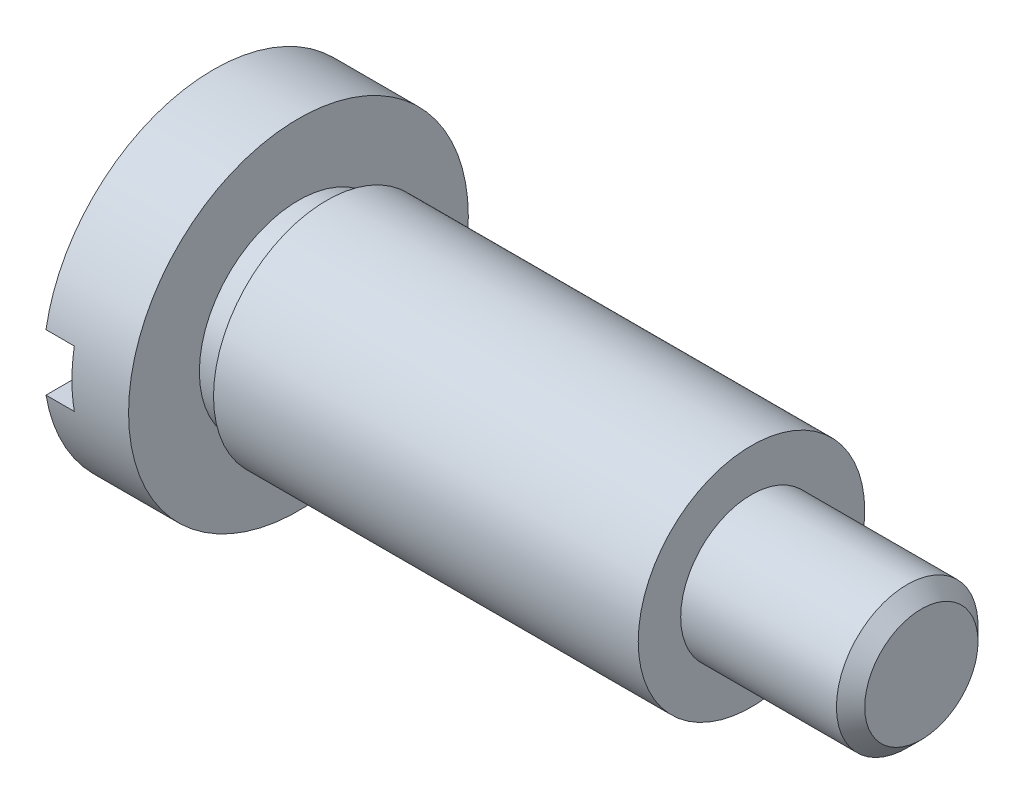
ISO-10303-21;
HEADER;
FILE_DESCRIPTION(('STEP AP214'),'2;1');
FILE_NAME('part.step','',(''),(''),'','','');
FILE_SCHEMA(('AUTOMOTIVE_DESIGN { 1 0 10303 214 1 1 1 1 }'));
ENDSEC;
DATA;
#1=APPLICATION_CONTEXT('core data for automotive mechanical design processes');
#2=APPLICATION_PROTOCOL_DEFINITION('international standard','automotive_design',2000,#1);
#3=PRODUCT_CONTEXT('',#1,'mechanical');
#4=PRODUCT('Part','Part','',(#3));
#5=PRODUCT_RELATED_PRODUCT_CATEGORY('part','',(#4));
#6=PRODUCT_DEFINITION_FORMATION('','',#4);
#7=PRODUCT_DEFINITION_CONTEXT('part definition',#1,'design');
#8=PRODUCT_DEFINITION('design','',#6,#7);
#9=PRODUCT_DEFINITION_SHAPE('','',#8);
#10=(LENGTH_UNIT() NAMED_UNIT(*) SI_UNIT(.MILLI.,.METRE.));
#11=(NAMED_UNIT(*) PLANE_ANGLE_UNIT() SI_UNIT($,.RADIAN.));
#12=(NAMED_UNIT(*) SI_UNIT($,.STERADIAN.) SOLID_ANGLE_UNIT());
#13=UNCERTAINTY_MEASURE_WITH_UNIT(LENGTH_MEASURE(1.E-05),#10,'distance_accuracy_value','');
#14=(GEOMETRIC_REPRESENTATION_CONTEXT(3) GLOBAL_UNCERTAINTY_ASSIGNED_CONTEXT((#13)) GLOBAL_UNIT_ASSIGNED_CONTEXT((#10,
#11,#12)) REPRESENTATION_CONTEXT('',''));
#15=CARTESIAN_POINT('',(0.,0.,0.));
#16=DIRECTION('',(0.,0.,1.));
#17=DIRECTION('',(1.,0.,0.));
#18=AXIS2_PLACEMENT_3D('',#15,#16,#17);
#19=CARTESIAN_POINT('',(0.,0.,0.));
#20=DIRECTION('',(1.,0.,0.));
#21=DIRECTION('',(0.,0.,-1.));
#22=AXIS2_PLACEMENT_3D('',#19,#20,#21);
#23=PLANE('',#22);
#24=CARTESIAN_POINT('',(0.,0.,0.));
#25=DIRECTION('',(-1.,0.,0.));
#26=DIRECTION('',(0.,0.,1.));
#27=AXIS2_PLACEMENT_3D('',#24,#25,#26);
#28=CIRCLE('',#27,3.);
#29=CARTESIAN_POINT('',(0.,0.5,2.95803989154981));
#30=VERTEX_POINT('',#29);
#31=CARTESIAN_POINT('',(0.,0.5,-2.95803989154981));
#32=VERTEX_POINT('',#31);
#33=EDGE_CURVE('E88',#30,#32,#28,.T.);
#34=ORIENTED_EDGE('',*,*,#33,.T.);
#35=DIRECTION('',(0.,0.,-1.));
#36=VECTOR('',#35,1.);
#37=CARTESIAN_POINT('',(0.,0.5,-3.35247769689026));
#38=LINE('',#37,#36);
#39=EDGE_CURVE('E82',#30,#32,#38,.T.);
#40=ORIENTED_EDGE('',*,*,#39,.F.);
#41=EDGE_LOOP('',(#34,#40));
#42=FACE_BOUND('',#41,.T.);
#43=ADVANCED_FACE('F33',(#42),#23,.F.);
#44=CARTESIAN_POINT('',(0.,-0.5,-2.95803989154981));
#45=VERTEX_POINT('',#44);
#46=CARTESIAN_POINT('',(0.,-0.5,2.95803989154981));
#47=VERTEX_POINT('',#46);
#48=EDGE_CURVE('E81',#45,#47,#28,.T.);
#49=ORIENTED_EDGE('',*,*,#48,.T.);
#50=DIRECTION('',(0.,0.,1.));
#51=VECTOR('',#50,1.);
#52=CARTESIAN_POINT('',(0.,-0.5,-3.35247769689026));
#53=LINE('',#52,#51);
#54=EDGE_CURVE('E74',#45,#47,#53,.T.);
#55=ORIENTED_EDGE('',*,*,#54,.F.);
#56=EDGE_LOOP('',(#49,#55));
#57=FACE_BOUND('',#56,.T.);
#58=ADVANCED_FACE('F80',(#57),#23,.F.);
#59=CARTESIAN_POINT('',(0.,0.,0.));
#60=DIRECTION('',(-1.,0.,0.));
#61=DIRECTION('',(0.,0.,1.));
#62=AXIS2_PLACEMENT_3D('',#59,#60,#61);
#63=CYLINDRICAL_SURFACE('',#62,3.);
#64=CARTESIAN_POINT('',(0.5,0.,0.));
#65=DIRECTION('',(-1.,0.,0.));
#66=DIRECTION('',(0.,0.,1.));
#67=AXIS2_PLACEMENT_3D('',#64,#65,#66);
#68=CIRCLE('',#67,3.);
#69=CARTESIAN_POINT('',(0.5,0.5,-2.95803989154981));
#70=VERTEX_POINT('',#69);
#71=CARTESIAN_POINT('',(0.5,-0.5,-2.95803989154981));
#72=VERTEX_POINT('',#71);
#73=EDGE_CURVE('E53',#70,#72,#68,.T.);
#74=ORIENTED_EDGE('',*,*,#73,.F.);
#75=DIRECTION('',(-1.,0.,0.));
#76=VECTOR('',#75,1.);
#77=CARTESIAN_POINT('',(0.,0.5,-2.95803989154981));
#78=LINE('',#77,#76);
#79=EDGE_CURVE('E11',#70,#32,#78,.T.);
#80=ORIENTED_EDGE('',*,*,#79,.T.);
#81=ORIENTED_EDGE('',*,*,#33,.F.);
#82=DIRECTION('',(-1.,0.,0.));
#83=VECTOR('',#82,1.);
#84=CARTESIAN_POINT('',(0.,0.5,2.95803989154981));
#85=LINE('',#84,#83);
#86=CARTESIAN_POINT('',(0.5,0.5,2.95803989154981));
#87=VERTEX_POINT('',#86);
#88=EDGE_CURVE('E106',#30,#87,#85,.F.);
#89=ORIENTED_EDGE('',*,*,#88,.T.);
#90=CARTESIAN_POINT('',(0.5,-0.5,2.95803989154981));
#91=VERTEX_POINT('',#90);
#92=EDGE_CURVE('E103',#91,#87,#68,.T.);
#93=ORIENTED_EDGE('',*,*,#92,.F.);
#94=DIRECTION('',(-1.,0.,0.));
#95=VECTOR('',#94,1.);
#96=CARTESIAN_POINT('',(0.,-0.5,2.95803989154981));
#97=LINE('',#96,#95);
#98=EDGE_CURVE('E87',#91,#47,#97,.T.);
#99=ORIENTED_EDGE('',*,*,#98,.T.);
#100=ORIENTED_EDGE('',*,*,#48,.F.);
#101=DIRECTION('',(-1.,0.,0.));
#102=VECTOR('',#101,1.);
#103=CARTESIAN_POINT('',(0.,-0.5,-2.95803989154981));
#104=LINE('',#103,#102);
#105=EDGE_CURVE('E41',#45,#72,#104,.F.);
#106=ORIENTED_EDGE('',*,*,#105,.T.);
#107=EDGE_LOOP('',(#74,#80,#81,#89,#93,#99,#100,#106));
#108=FACE_BOUND('',#107,.T.);
#109=CARTESIAN_POINT('',(1.5,0.,0.));
#110=DIRECTION('',(-1.,0.,0.));
#111=DIRECTION('',(0.,0.,1.));
#112=AXIS2_PLACEMENT_3D('',#109,#110,#111);
#113=CIRCLE('',#112,3.);
#114=CARTESIAN_POINT('',(1.5,0.,3.));
#115=VERTEX_POINT('',#114);
#116=EDGE_CURVE('E89',#115,#115,#113,.T.);
#117=ORIENTED_EDGE('',*,*,#116,.T.);
#118=EDGE_LOOP('',(#117));
#119=FACE_BOUND('',#118,.T.);
#120=ADVANCED_FACE('F84',(#108,#119),#63,.T.);
#121=CARTESIAN_POINT('',(1.5,2.23989718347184,0.));
#122=DIRECTION('',(-1.,0.,0.));
#123=DIRECTION('',(0.,0.,1.));
#124=AXIS2_PLACEMENT_3D('',#121,#122,#123);
#125=PLANE('',#124);
#126=ORIENTED_EDGE('',*,*,#116,.F.);
#127=EDGE_LOOP('',(#126));
#128=FACE_BOUND('',#127,.T.);
#129=CARTESIAN_POINT('',(1.5,0.,0.));
#130=DIRECTION('',(-1.,0.,0.));
#131=DIRECTION('',(0.,0.,1.));
#132=AXIS2_PLACEMENT_3D('',#129,#130,#131);
#133=CIRCLE('',#132,1.75);
#134=CARTESIAN_POINT('',(1.5,0.,1.75));
#135=VERTEX_POINT('',#134);
#136=EDGE_CURVE('E94',#135,#135,#133,.T.);
#137=ORIENTED_EDGE('',*,*,#136,.T.);
#138=EDGE_LOOP('',(#137));
#139=FACE_BOUND('',#138,.T.);
#140=ADVANCED_FACE('F133',(#128,#139),#125,.F.);
#141=CARTESIAN_POINT('',(0.,0.,0.));
#142=DIRECTION('',(-1.,0.,0.));
#143=DIRECTION('',(0.,0.,1.));
#144=AXIS2_PLACEMENT_3D('',#141,#142,#143);
#145=CYLINDRICAL_SURFACE('',#144,1.75);
#146=ORIENTED_EDGE('',*,*,#136,.F.);
#147=EDGE_LOOP('',(#146));
#148=FACE_BOUND('',#147,.T.);
#149=CARTESIAN_POINT('',(2.,0.,0.));
#150=DIRECTION('',(-1.,0.,0.));
#151=DIRECTION('',(0.,0.,1.));
#152=AXIS2_PLACEMENT_3D('',#149,#150,#151);
#153=CIRCLE('',#152,1.75);
#154=CARTESIAN_POINT('',(2.,0.,1.75));
#155=VERTEX_POINT('',#154);
#156=EDGE_CURVE('E128',#155,#155,#153,.T.);
#157=ORIENTED_EDGE('',*,*,#156,.T.);
#158=EDGE_LOOP('',(#157));
#159=FACE_BOUND('',#158,.T.);
#160=ADVANCED_FACE('F135',(#148,#159),#145,.T.);
#161=CARTESIAN_POINT('',(2.,2.,0.));
#162=DIRECTION('',(1.,0.,0.));
#163=DIRECTION('',(0.,0.,-1.));
#164=AXIS2_PLACEMENT_3D('',#161,#162,#163);
#165=PLANE('',#164);
#166=ORIENTED_EDGE('',*,*,#156,.F.);
#167=EDGE_LOOP('',(#166));
#168=FACE_BOUND('',#167,.T.);
#169=CARTESIAN_POINT('',(2.,0.,0.));
#170=DIRECTION('',(-1.,0.,0.));
#171=DIRECTION('',(0.,0.,1.));
#172=AXIS2_PLACEMENT_3D('',#169,#170,#171);
#173=CIRCLE('',#172,2.);
#174=CARTESIAN_POINT('',(2.,0.,2.));
#175=VERTEX_POINT('',#174);
#176=EDGE_CURVE('E125',#175,#175,#173,.T.);
#177=ORIENTED_EDGE('',*,*,#176,.T.);
#178=EDGE_LOOP('',(#177));
#179=FACE_BOUND('',#178,.T.);
#180=ADVANCED_FACE('F138',(#168,#179),#165,.F.);
#181=CARTESIAN_POINT('',(0.,0.,0.));
#182=DIRECTION('',(-1.,0.,0.));
#183=DIRECTION('',(0.,0.,1.));
#184=AXIS2_PLACEMENT_3D('',#181,#182,#183);
#185=CYLINDRICAL_SURFACE('',#184,2.);
#186=ORIENTED_EDGE('',*,*,#176,.F.);
#187=EDGE_LOOP('',(#186));
#188=FACE_BOUND('',#187,.T.);
#189=CARTESIAN_POINT('',(9.5,0.,0.));
#190=DIRECTION('',(-1.,0.,0.));
#191=DIRECTION('',(0.,0.,1.));
#192=AXIS2_PLACEMENT_3D('',#189,#190,#191);
#193=CIRCLE('',#192,2.);
#194=CARTESIAN_POINT('',(9.5,0.,2.));
#195=VERTEX_POINT('',#194);
#196=EDGE_CURVE('E122',#195,#195,#193,.T.);
#197=ORIENTED_EDGE('',*,*,#196,.T.);
#198=EDGE_LOOP('',(#197));
#199=FACE_BOUND('',#198,.T.);
#200=ADVANCED_FACE('F144',(#188,#199),#185,.T.);
#201=CARTESIAN_POINT('',(9.5,2.,0.));
#202=DIRECTION('',(-1.,0.,0.));
#203=DIRECTION('',(0.,0.,1.));
#204=AXIS2_PLACEMENT_3D('',#201,#202,#203);
#205=PLANE('',#204);
#206=ORIENTED_EDGE('',*,*,#196,.F.);
#207=EDGE_LOOP('',(#206));
#208=FACE_BOUND('',#207,.T.);
#209=CARTESIAN_POINT('',(9.5,0.,0.));
#210=DIRECTION('',(-1.,0.,0.));
#211=DIRECTION('',(0.,0.,1.));
#212=AXIS2_PLACEMENT_3D('',#209,#210,#211);
#213=CIRCLE('',#212,1.25);
#214=CARTESIAN_POINT('',(9.5,0.,1.25));
#215=VERTEX_POINT('',#214);
#216=EDGE_CURVE('E119',#215,#215,#213,.T.);
#217=ORIENTED_EDGE('',*,*,#216,.T.);
#218=EDGE_LOOP('',(#217));
#219=FACE_BOUND('',#218,.T.);
#220=ADVANCED_FACE('F150',(#208,#219),#205,.F.);
#221=CARTESIAN_POINT('',(0.,0.,0.));
#222=DIRECTION('',(-1.,0.,0.));
#223=DIRECTION('',(0.,0.,1.));
#224=AXIS2_PLACEMENT_3D('',#221,#222,#223);
#225=CYLINDRICAL_SURFACE('',#224,1.25);
#226=CARTESIAN_POINT('',(12.25,0.,0.));
#227=DIRECTION('',(-1.,0.,0.));
#228=DIRECTION('',(0.,0.,1.));
#229=AXIS2_PLACEMENT_3D('',#226,#227,#228);
#230=CIRCLE('',#229,1.25);
#231=CARTESIAN_POINT('',(12.25,0.,1.25));
#232=VERTEX_POINT('',#231);
#233=EDGE_CURVE('E92',#232,#232,#230,.T.);
#234=ORIENTED_EDGE('',*,*,#233,.T.);
#235=EDGE_LOOP('',(#234));
#236=FACE_BOUND('',#235,.T.);
#237=ORIENTED_EDGE('',*,*,#216,.F.);
#238=EDGE_LOOP('',(#237));
#239=FACE_BOUND('',#238,.T.);
#240=ADVANCED_FACE('F156',(#236,#239),#225,.T.);
#241=CARTESIAN_POINT('',(12.5,1.25,0.));
#242=DIRECTION('',(-1.,0.,0.));
#243=DIRECTION('',(0.,0.,1.));
#244=AXIS2_PLACEMENT_3D('',#241,#242,#243);
#245=PLANE('',#244);
#246=CARTESIAN_POINT('',(12.5,0.,0.));
#247=DIRECTION('',(-1.,0.,0.));
#248=DIRECTION('',(0.,0.,1.));
#249=AXIS2_PLACEMENT_3D('',#246,#247,#248);
#250=CIRCLE('',#249,1.);
#251=CARTESIAN_POINT('',(12.5,0.,1.));
#252=VERTEX_POINT('',#251);
#253=EDGE_CURVE('E100',#252,#252,#250,.F.);
#254=ORIENTED_EDGE('',*,*,#253,.T.);
#255=EDGE_LOOP('',(#254));
#256=FACE_BOUND('',#255,.T.);
#257=ADVANCED_FACE('F161',(#256),#245,.F.);
#258=CARTESIAN_POINT('',(12.25,0.,0.));
#259=DIRECTION('',(-1.,0.,0.));
#260=DIRECTION('',(0.,0.,1.));
#261=AXIS2_PLACEMENT_3D('',#258,#259,#260);
#262=CONICAL_SURFACE('',#261,1.25,0.785398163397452);
#263=ORIENTED_EDGE('',*,*,#253,.F.);
#264=EDGE_LOOP('',(#263));
#265=FACE_BOUND('',#264,.T.);
#266=ORIENTED_EDGE('',*,*,#233,.F.);
#267=EDGE_LOOP('',(#266));
#268=FACE_BOUND('',#267,.T.);
#269=ADVANCED_FACE('F35',(#265,#268),#262,.T.);
#270=CARTESIAN_POINT('',(0.5,0.5,-3.35247769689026));
#271=DIRECTION('',(0.,1.,0.));
#272=DIRECTION('',(0.,0.,1.));
#273=AXIS2_PLACEMENT_3D('',#270,#271,#272);
#274=PLANE('',#273);
#275=DIRECTION('',(0.,0.,-1.));
#276=VECTOR('',#275,1.);
#277=CARTESIAN_POINT('',(0.5,0.5,-3.35247769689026));
#278=LINE('',#277,#276);
#279=EDGE_CURVE('E113',#87,#70,#278,.T.);
#280=ORIENTED_EDGE('',*,*,#279,.F.);
#281=ORIENTED_EDGE('',*,*,#88,.F.);
#282=ORIENTED_EDGE('',*,*,#39,.T.);
#283=ORIENTED_EDGE('',*,*,#79,.F.);
#284=EDGE_LOOP('',(#280,#281,#282,#283));
#285=FACE_BOUND('',#284,.T.);
#286=ADVANCED_FACE('F112',(#285),#274,.F.);
#287=CARTESIAN_POINT('',(0.5,-0.5,-3.35247769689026));
#288=DIRECTION('',(0.,-1.,0.));
#289=DIRECTION('',(0.,0.,-1.));
#290=AXIS2_PLACEMENT_3D('',#287,#288,#289);
#291=PLANE('',#290);
#292=DIRECTION('',(0.,0.,1.));
#293=VECTOR('',#292,1.);
#294=CARTESIAN_POINT('',(0.5,-0.5,-3.35247769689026));
#295=LINE('',#294,#293);
#296=EDGE_CURVE('E48',#72,#91,#295,.T.);
#297=ORIENTED_EDGE('',*,*,#296,.F.);
#298=ORIENTED_EDGE('',*,*,#105,.F.);
#299=ORIENTED_EDGE('',*,*,#54,.T.);
#300=ORIENTED_EDGE('',*,*,#98,.F.);
#301=EDGE_LOOP('',(#297,#298,#299,#300));
#302=FACE_BOUND('',#301,.T.);
#303=ADVANCED_FACE('F73',(#302),#291,.F.);
#304=CARTESIAN_POINT('',(0.5,0.,0.));
#305=DIRECTION('',(-1.,0.,0.));
#306=DIRECTION('',(0.,0.,1.));
#307=AXIS2_PLACEMENT_3D('',#304,#305,#306);
#308=PLANE('',#307);
#309=ORIENTED_EDGE('',*,*,#73,.T.);
#310=ORIENTED_EDGE('',*,*,#296,.T.);
#311=ORIENTED_EDGE('',*,*,#92,.T.);
#312=ORIENTED_EDGE('',*,*,#279,.T.);
#313=EDGE_LOOP('',(#309,#310,#311,#312));
#314=FACE_BOUND('',#313,.T.);
#315=ADVANCED_FACE('F249',(#314),#308,.T.);
#316=CLOSED_SHELL('',(#43,#58,#120,#140,#160,#180,#200,#220,#240,#257,#269,#286,#303,#315));
#317=MANIFOLD_SOLID_BREP('B2',#316);
#318=ADVANCED_BREP_SHAPE_REPRESENTATION('',(#18,#317),#14);
#319=SHAPE_DEFINITION_REPRESENTATION(#9,#318);
ENDSEC;
END-ISO-10303-21;
